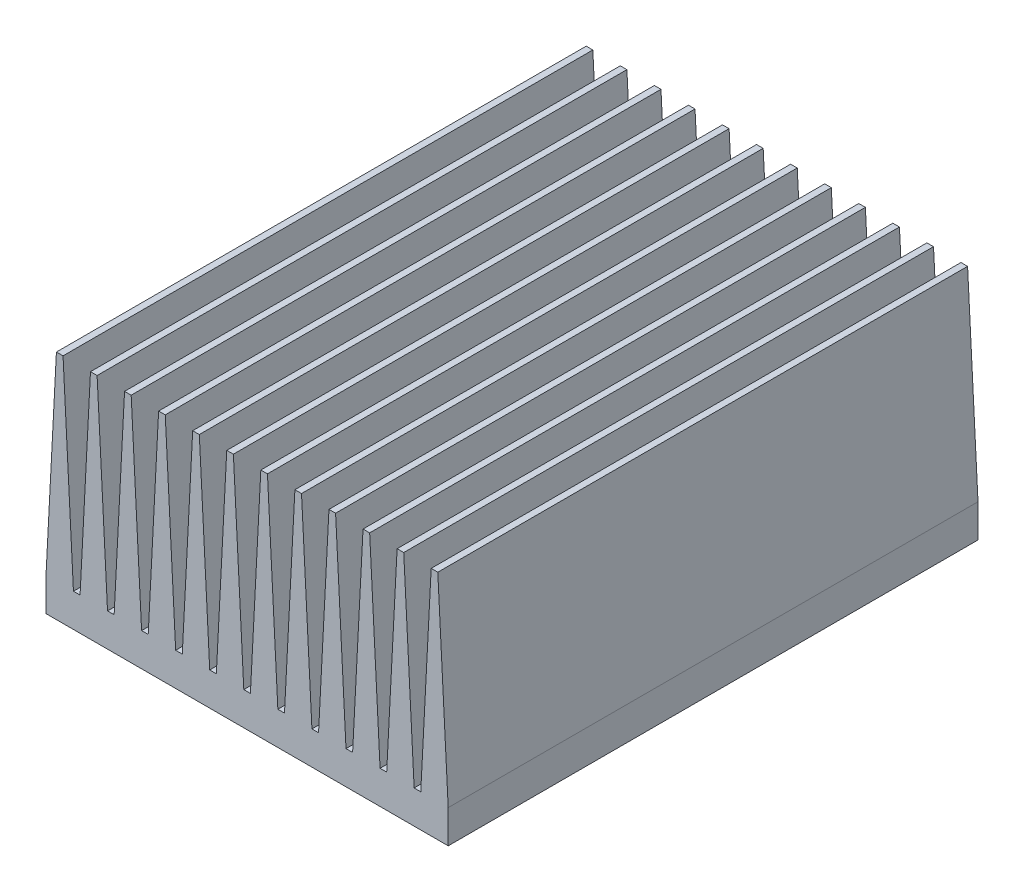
from build123d import *

# Parameters (mm, degrees)
BOSS_EXTRUDE1_DEPTH = 80


with BuildPart() as part:
    # Sketch1 → Boss-Extrude1 (new body)
    with BuildSketch(Plane.XY):
        Polygon((-30.366800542, 0), (30.366800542, 0), (30.366800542, 5), (28.794567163, 35), (27.794567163, 35), (26.222333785, 5), (25.222333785, 5), (23.650100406, 35), (22.650100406, 35), (21.077867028, 5), (20.077867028, 5), (18.505633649, 35), (17.505633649, 35), (15.933400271, 5), (14.933400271, 5), (13.361166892, 35), (12.361166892, 35), (10.788933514, 5), (9.788933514, 5), (8.216700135, 35), (7.216700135, 35), (5.644466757, 5), (4.644466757, 5), (3.072233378, 35), (2.072233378, 35), (0.5, 5), (-0.5, 5), (-2.072233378, 35), (-3.072233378, 35), (-4.644466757, 5), (-5.644466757, 5), (-7.216700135, 35), (-8.216700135, 35), (-9.788933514, 5), (-10.788933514, 5), (-12.361166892, 35), (-13.361166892, 35), (-14.933400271, 5), (-15.933400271, 5), (-17.505633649, 35), (-18.505633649, 35), (-20.077867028, 5), (-21.077867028, 5), (-22.650100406, 35), (-23.650100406, 35), (-25.222333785, 5), (-26.222333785, 5), (-27.794567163, 35), (-28.794567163, 35), (-30.366800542, 5), align=None)
    extrude(amount=BOSS_EXTRUDE1_DEPTH)


solid = part.part
